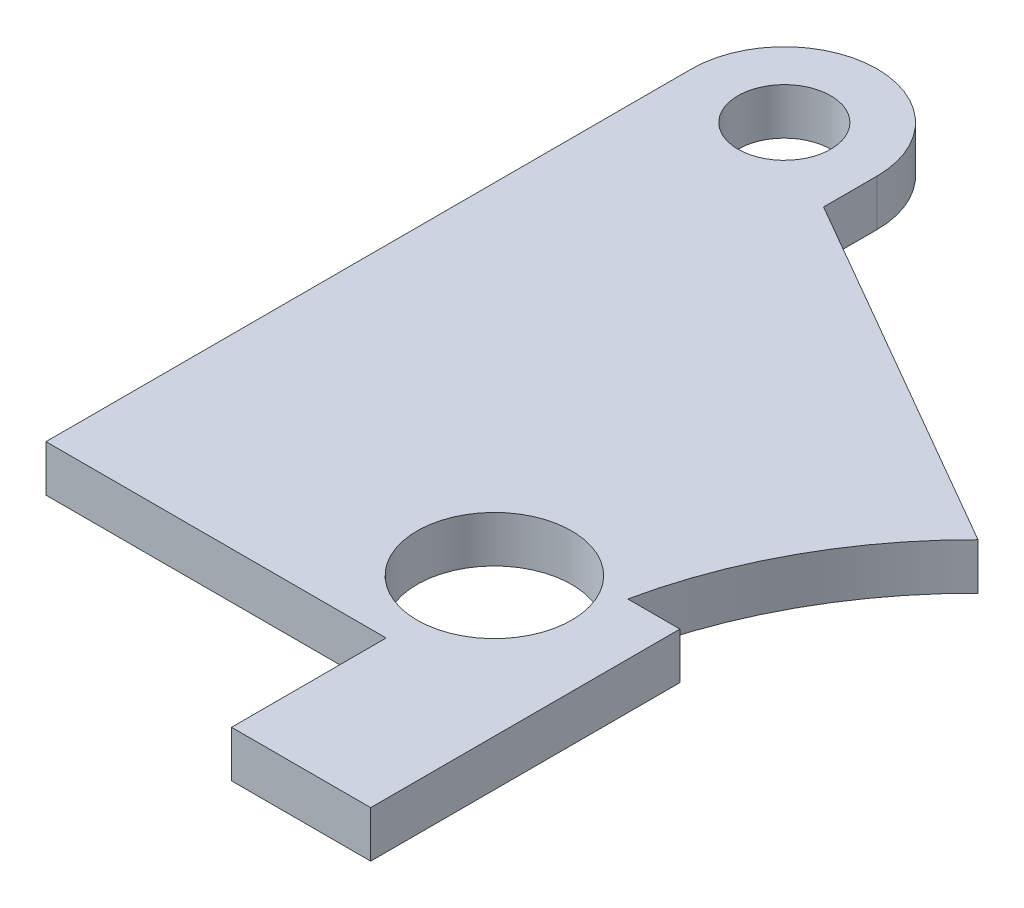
ISO-10303-21;
HEADER;
FILE_DESCRIPTION(('STEP AP214'),'2;1');
FILE_NAME('part.step','',(''),(''),'','','');
FILE_SCHEMA(('AUTOMOTIVE_DESIGN { 1 0 10303 214 1 1 1 1 }'));
ENDSEC;
DATA;
#1=APPLICATION_CONTEXT('core data for automotive mechanical design processes');
#2=APPLICATION_PROTOCOL_DEFINITION('international standard','automotive_design',2000,#1);
#3=PRODUCT_CONTEXT('',#1,'mechanical');
#4=PRODUCT('Part','Part','',(#3));
#5=PRODUCT_RELATED_PRODUCT_CATEGORY('part','',(#4));
#6=PRODUCT_DEFINITION_FORMATION('','',#4);
#7=PRODUCT_DEFINITION_CONTEXT('part definition',#1,'design');
#8=PRODUCT_DEFINITION('design','',#6,#7);
#9=PRODUCT_DEFINITION_SHAPE('','',#8);
#10=(LENGTH_UNIT() NAMED_UNIT(*) SI_UNIT(.MILLI.,.METRE.));
#11=(NAMED_UNIT(*) PLANE_ANGLE_UNIT() SI_UNIT($,.RADIAN.));
#12=(NAMED_UNIT(*) SI_UNIT($,.STERADIAN.) SOLID_ANGLE_UNIT());
#13=UNCERTAINTY_MEASURE_WITH_UNIT(LENGTH_MEASURE(1.E-05),#10,'distance_accuracy_value','');
#14=(GEOMETRIC_REPRESENTATION_CONTEXT(3) GLOBAL_UNCERTAINTY_ASSIGNED_CONTEXT((#13)) GLOBAL_UNIT_ASSIGNED_CONTEXT((#10,
#11,#12)) REPRESENTATION_CONTEXT('',''));
#15=CARTESIAN_POINT('',(0.,0.,0.));
#16=DIRECTION('',(0.,0.,1.));
#17=DIRECTION('',(1.,0.,0.));
#18=AXIS2_PLACEMENT_3D('',#15,#16,#17);
#19=CARTESIAN_POINT('',(11.9115308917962,3.,-51.6599608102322));
#20=DIRECTION('',(0.,1.,0.));
#21=DIRECTION('',(0.,0.,1.));
#22=AXIS2_PLACEMENT_3D('',#19,#20,#21);
#23=PLANE('',#22);
#24=CARTESIAN_POINT('',(11.9115308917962,3.,-51.6599608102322));
#25=DIRECTION('',(0.,1.,0.));
#26=DIRECTION('',(0.,0.,1.));
#27=AXIS2_PLACEMENT_3D('',#24,#25,#26);
#28=CIRCLE('',#27,3.);
#29=CARTESIAN_POINT('',(11.9115308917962,3.,-48.6599608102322));
#30=VERTEX_POINT('',#29);
#31=EDGE_CURVE('E143',#30,#30,#28,.T.);
#32=ORIENTED_EDGE('',*,*,#31,.F.);
#33=EDGE_LOOP('',(#32));
#34=FACE_BOUND('',#33,.T.);
#35=CARTESIAN_POINT('',(11.9115308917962,3.,-51.6599608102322));
#36=DIRECTION('',(0.,1.,0.));
#37=DIRECTION('',(0.,0.,1.));
#38=AXIS2_PLACEMENT_3D('',#35,#36,#37);
#39=CIRCLE('',#38,6.);
#40=CARTESIAN_POINT('',(17.9115308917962,3.,-51.6599608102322));
#41=VERTEX_POINT('',#40);
#42=CARTESIAN_POINT('',(5.91168114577,3.,-51.7024228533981));
#43=VERTEX_POINT('',#42);
#44=EDGE_CURVE('E158',#41,#43,#39,.T.);
#45=ORIENTED_EDGE('',*,*,#44,.T.);
#46=DIRECTION('',(0.,0.,1.));
#47=VECTOR('',#46,1.);
#48=CARTESIAN_POINT('',(5.91168114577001,3.,-9.9056960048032));
#49=LINE('',#48,#47);
#50=CARTESIAN_POINT('',(5.91168114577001,3.,-9.9056960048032));
#51=VERTEX_POINT('',#50);
#52=EDGE_CURVE('E96',#43,#51,#49,.T.);
#53=ORIENTED_EDGE('',*,*,#52,.T.);
#54=DIRECTION('',(1.,0.,0.));
#55=VECTOR('',#54,1.);
#56=CARTESIAN_POINT('',(5.91168114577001,3.,-9.9056960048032));
#57=LINE('',#56,#55);
#58=CARTESIAN_POINT('',(27.9115308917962,3.,-9.90569600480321));
#59=VERTEX_POINT('',#58);
#60=EDGE_CURVE('E179',#51,#59,#57,.T.);
#61=ORIENTED_EDGE('',*,*,#60,.T.);
#62=DIRECTION('',(0.,0.,1.));
#63=VECTOR('',#62,1.);
#64=CARTESIAN_POINT('',(27.9115308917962,3.,0.0943039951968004));
#65=LINE('',#64,#63);
#66=CARTESIAN_POINT('',(27.9115308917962,3.,0.0943039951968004));
#67=VERTEX_POINT('',#66);
#68=EDGE_CURVE('E198',#59,#67,#65,.T.);
#69=ORIENTED_EDGE('',*,*,#68,.T.);
#70=DIRECTION('',(1.,0.,0.));
#71=VECTOR('',#70,1.);
#72=CARTESIAN_POINT('',(27.9115308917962,3.,0.0943039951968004));
#73=LINE('',#72,#71);
#74=CARTESIAN_POINT('',(36.9115308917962,3.,0.0943039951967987));
#75=VERTEX_POINT('',#74);
#76=EDGE_CURVE('E195',#67,#75,#73,.T.);
#77=ORIENTED_EDGE('',*,*,#76,.T.);
#78=DIRECTION('',(0.,0.,-1.));
#79=VECTOR('',#78,1.);
#80=CARTESIAN_POINT('',(36.9115308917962,3.,0.0943039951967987));
#81=LINE('',#80,#79);
#82=CARTESIAN_POINT('',(36.9115308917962,3.,-19.9056960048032));
#83=VERTEX_POINT('',#82);
#84=EDGE_CURVE('E197',#75,#83,#81,.T.);
#85=ORIENTED_EDGE('',*,*,#84,.T.);
#86=DIRECTION('',(-1.,0.,0.));
#87=VECTOR('',#86,1.);
#88=CARTESIAN_POINT('',(33.5390089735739,3.,-19.9056960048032));
#89=LINE('',#88,#87);
#90=CARTESIAN_POINT('',(33.5390089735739,3.,-19.9056960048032));
#91=VERTEX_POINT('',#90);
#92=EDGE_CURVE('E121',#83,#91,#89,.T.);
#93=ORIENTED_EDGE('',*,*,#92,.T.);
#94=CARTESIAN_POINT('',(61.9115308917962,3.,-13.9056960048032));
#95=DIRECTION('',(0.,-1.,0.));
#96=DIRECTION('',(0.,0.,1.));
#97=AXIS2_PLACEMENT_3D('',#94,#95,#96);
#98=CIRCLE('',#97,29.);
#99=CARTESIAN_POINT('',(41.5454185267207,3.,-34.5508278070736));
#100=VERTEX_POINT('',#99);
#101=EDGE_CURVE('E115',#91,#100,#98,.T.);
#102=ORIENTED_EDGE('',*,*,#101,.T.);
#103=DIRECTION('',(-0.866025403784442,0.,-0.499999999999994));
#104=VECTOR('',#103,1.);
#105=CARTESIAN_POINT('',(41.5454185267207,3.,-34.5508278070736));
#106=LINE('',#105,#104);
#107=CARTESIAN_POINT('',(17.9115308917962,3.,-48.1958591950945));
#108=VERTEX_POINT('',#107);
#109=EDGE_CURVE('E119',#100,#108,#106,.T.);
#110=ORIENTED_EDGE('',*,*,#109,.T.);
#111=DIRECTION('',(0.,0.,-1.));
#112=VECTOR('',#111,1.);
#113=CARTESIAN_POINT('',(17.9115308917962,3.,-51.6599608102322));
#114=LINE('',#113,#112);
#115=EDGE_CURVE('E47',#108,#41,#114,.T.);
#116=ORIENTED_EDGE('',*,*,#115,.T.);
#117=EDGE_LOOP('',(#45,#53,#61,#69,#77,#85,#93,#102,#110,#116));
#118=FACE_BOUND('',#117,.T.);
#119=CARTESIAN_POINT('',(27.9115308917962,3.,-16.9056960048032));
#120=DIRECTION('',(0.,1.,0.));
#121=DIRECTION('',(0.,0.,1.));
#122=AXIS2_PLACEMENT_3D('',#119,#120,#121);
#123=CIRCLE('',#122,5.);
#124=CARTESIAN_POINT('',(27.9115308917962,3.,-11.9056960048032));
#125=VERTEX_POINT('',#124);
#126=EDGE_CURVE('E209',#125,#125,#123,.T.);
#127=ORIENTED_EDGE('',*,*,#126,.F.);
#128=EDGE_LOOP('',(#127));
#129=FACE_BOUND('',#128,.T.);
#130=ADVANCED_FACE('F30',(#34,#118,#129),#23,.T.);
#131=CARTESIAN_POINT('',(11.9115308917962,0.,-51.6599608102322));
#132=DIRECTION('',(0.,1.,0.));
#133=DIRECTION('',(0.,0.,1.));
#134=AXIS2_PLACEMENT_3D('',#131,#132,#133);
#135=PLANE('',#134);
#136=CARTESIAN_POINT('',(11.9115308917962,0.,-51.6599608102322));
#137=DIRECTION('',(0.,1.,0.));
#138=DIRECTION('',(0.,0.,1.));
#139=AXIS2_PLACEMENT_3D('',#136,#137,#138);
#140=CIRCLE('',#139,3.);
#141=CARTESIAN_POINT('',(11.9115308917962,0.,-48.6599608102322));
#142=VERTEX_POINT('',#141);
#143=EDGE_CURVE('E206',#142,#142,#140,.T.);
#144=ORIENTED_EDGE('',*,*,#143,.T.);
#145=EDGE_LOOP('',(#144));
#146=FACE_BOUND('',#145,.T.);
#147=CARTESIAN_POINT('',(11.9115308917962,0.,-51.6599608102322));
#148=DIRECTION('',(0.,1.,0.));
#149=DIRECTION('',(0.,0.,1.));
#150=AXIS2_PLACEMENT_3D('',#147,#148,#149);
#151=CIRCLE('',#150,6.);
#152=CARTESIAN_POINT('',(17.9115308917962,0.,-51.6599608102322));
#153=VERTEX_POINT('',#152);
#154=CARTESIAN_POINT('',(5.91168114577,0.,-51.7024228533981));
#155=VERTEX_POINT('',#154);
#156=EDGE_CURVE('E139',#153,#155,#151,.T.);
#157=ORIENTED_EDGE('',*,*,#156,.F.);
#158=DIRECTION('',(0.,0.,-1.));
#159=VECTOR('',#158,1.);
#160=CARTESIAN_POINT('',(17.9115308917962,0.,-51.6599608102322));
#161=LINE('',#160,#159);
#162=CARTESIAN_POINT('',(17.9115308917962,0.,-48.1958591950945));
#163=VERTEX_POINT('',#162);
#164=EDGE_CURVE('E88',#163,#153,#161,.T.);
#165=ORIENTED_EDGE('',*,*,#164,.F.);
#166=DIRECTION('',(-0.866025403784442,0.,-0.499999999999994));
#167=VECTOR('',#166,1.);
#168=CARTESIAN_POINT('',(41.5454185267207,0.,-34.5508278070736));
#169=LINE('',#168,#167);
#170=CARTESIAN_POINT('',(41.5454185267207,0.,-34.5508278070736));
#171=VERTEX_POINT('',#170);
#172=EDGE_CURVE('E82',#171,#163,#169,.T.);
#173=ORIENTED_EDGE('',*,*,#172,.F.);
#174=CARTESIAN_POINT('',(61.9115308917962,0.,-13.9056960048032));
#175=DIRECTION('',(0.,-1.,0.));
#176=DIRECTION('',(0.,0.,1.));
#177=AXIS2_PLACEMENT_3D('',#174,#175,#176);
#178=CIRCLE('',#177,29.);
#179=CARTESIAN_POINT('',(33.5390089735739,0.,-19.9056960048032));
#180=VERTEX_POINT('',#179);
#181=EDGE_CURVE('E129',#180,#171,#178,.T.);
#182=ORIENTED_EDGE('',*,*,#181,.F.);
#183=DIRECTION('',(-1.,0.,0.));
#184=VECTOR('',#183,1.);
#185=CARTESIAN_POINT('',(33.5390089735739,0.,-19.9056960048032));
#186=LINE('',#185,#184);
#187=CARTESIAN_POINT('',(36.9115308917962,0.,-19.9056960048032));
#188=VERTEX_POINT('',#187);
#189=EDGE_CURVE('E153',#188,#180,#186,.T.);
#190=ORIENTED_EDGE('',*,*,#189,.F.);
#191=DIRECTION('',(0.,0.,-1.));
#192=VECTOR('',#191,1.);
#193=CARTESIAN_POINT('',(36.9115308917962,0.,0.0943039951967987));
#194=LINE('',#193,#192);
#195=CARTESIAN_POINT('',(36.9115308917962,0.,0.0943039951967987));
#196=VERTEX_POINT('',#195);
#197=EDGE_CURVE('E151',#196,#188,#194,.T.);
#198=ORIENTED_EDGE('',*,*,#197,.F.);
#199=DIRECTION('',(1.,0.,0.));
#200=VECTOR('',#199,1.);
#201=CARTESIAN_POINT('',(27.9115308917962,0.,0.0943039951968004));
#202=LINE('',#201,#200);
#203=CARTESIAN_POINT('',(27.9115308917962,0.,0.0943039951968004));
#204=VERTEX_POINT('',#203);
#205=EDGE_CURVE('E149',#204,#196,#202,.T.);
#206=ORIENTED_EDGE('',*,*,#205,.F.);
#207=DIRECTION('',(0.,0.,1.));
#208=VECTOR('',#207,1.);
#209=CARTESIAN_POINT('',(27.9115308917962,0.,0.0943039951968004));
#210=LINE('',#209,#208);
#211=CARTESIAN_POINT('',(27.9115308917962,0.,-9.90569600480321));
#212=VERTEX_POINT('',#211);
#213=EDGE_CURVE('E147',#212,#204,#210,.T.);
#214=ORIENTED_EDGE('',*,*,#213,.F.);
#215=DIRECTION('',(1.,0.,0.));
#216=VECTOR('',#215,1.);
#217=CARTESIAN_POINT('',(5.91168114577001,0.,-9.9056960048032));
#218=LINE('',#217,#216);
#219=CARTESIAN_POINT('',(5.91168114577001,0.,-9.9056960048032));
#220=VERTEX_POINT('',#219);
#221=EDGE_CURVE('E145',#220,#212,#218,.T.);
#222=ORIENTED_EDGE('',*,*,#221,.F.);
#223=DIRECTION('',(0.,0.,1.));
#224=VECTOR('',#223,1.);
#225=CARTESIAN_POINT('',(5.91168114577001,0.,-9.9056960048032));
#226=LINE('',#225,#224);
#227=EDGE_CURVE('E142',#155,#220,#226,.T.);
#228=ORIENTED_EDGE('',*,*,#227,.F.);
#229=EDGE_LOOP('',(#157,#165,#173,#182,#190,#198,#206,#214,#222,#228));
#230=FACE_BOUND('',#229,.T.);
#231=CARTESIAN_POINT('',(27.9115308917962,0.,-16.9056960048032));
#232=DIRECTION('',(0.,1.,0.));
#233=DIRECTION('',(0.,0.,1.));
#234=AXIS2_PLACEMENT_3D('',#231,#232,#233);
#235=CIRCLE('',#234,5.);
#236=CARTESIAN_POINT('',(27.9115308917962,0.,-11.9056960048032));
#237=VERTEX_POINT('',#236);
#238=EDGE_CURVE('E212',#237,#237,#235,.T.);
#239=ORIENTED_EDGE('',*,*,#238,.T.);
#240=EDGE_LOOP('',(#239));
#241=FACE_BOUND('',#240,.T.);
#242=ADVANCED_FACE('F183',(#146,#230,#241),#135,.F.);
#243=CARTESIAN_POINT('',(11.9115308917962,3.,-51.6599608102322));
#244=DIRECTION('',(0.,-1.,0.));
#245=DIRECTION('',(0.,0.,-1.));
#246=AXIS2_PLACEMENT_3D('',#243,#244,#245);
#247=CYLINDRICAL_SURFACE('',#246,6.);
#248=ORIENTED_EDGE('',*,*,#156,.T.);
#249=DIRECTION('',(0.,-1.,0.));
#250=VECTOR('',#249,1.);
#251=CARTESIAN_POINT('',(5.91168114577,3.,-51.7024228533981));
#252=LINE('',#251,#250);
#253=EDGE_CURVE('E11',#43,#155,#252,.T.);
#254=ORIENTED_EDGE('',*,*,#253,.F.);
#255=ORIENTED_EDGE('',*,*,#44,.F.);
#256=DIRECTION('',(0.,-1.,0.));
#257=VECTOR('',#256,1.);
#258=CARTESIAN_POINT('',(17.9115308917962,3.,-51.6599608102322));
#259=LINE('',#258,#257);
#260=EDGE_CURVE('E135',#41,#153,#259,.T.);
#261=ORIENTED_EDGE('',*,*,#260,.T.);
#262=EDGE_LOOP('',(#248,#254,#255,#261));
#263=FACE_BOUND('',#262,.T.);
#264=ADVANCED_FACE('F32',(#263),#247,.T.);
#265=CARTESIAN_POINT('',(5.91168114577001,3.,-9.9056960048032));
#266=DIRECTION('',(1.,0.,0.));
#267=DIRECTION('',(0.,0.,-1.));
#268=AXIS2_PLACEMENT_3D('',#265,#266,#267);
#269=PLANE('',#268);
#270=ORIENTED_EDGE('',*,*,#227,.T.);
#271=DIRECTION('',(0.,-1.,0.));
#272=VECTOR('',#271,1.);
#273=CARTESIAN_POINT('',(5.91168114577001,3.,-9.9056960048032));
#274=LINE('',#273,#272);
#275=EDGE_CURVE('E39',#51,#220,#274,.T.);
#276=ORIENTED_EDGE('',*,*,#275,.F.);
#277=ORIENTED_EDGE('',*,*,#52,.F.);
#278=ORIENTED_EDGE('',*,*,#253,.T.);
#279=EDGE_LOOP('',(#270,#276,#277,#278));
#280=FACE_BOUND('',#279,.T.);
#281=ADVANCED_FACE('F253',(#280),#269,.F.);
#282=CARTESIAN_POINT('',(5.91168114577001,3.,-9.9056960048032));
#283=DIRECTION('',(0.,0.,-1.));
#284=DIRECTION('',(-1.,0.,0.));
#285=AXIS2_PLACEMENT_3D('',#282,#283,#284);
#286=PLANE('',#285);
#287=ORIENTED_EDGE('',*,*,#221,.T.);
#288=DIRECTION('',(0.,-1.,0.));
#289=VECTOR('',#288,1.);
#290=CARTESIAN_POINT('',(27.9115308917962,3.,-9.90569600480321));
#291=LINE('',#290,#289);
#292=EDGE_CURVE('E171',#59,#212,#291,.T.);
#293=ORIENTED_EDGE('',*,*,#292,.F.);
#294=ORIENTED_EDGE('',*,*,#60,.F.);
#295=ORIENTED_EDGE('',*,*,#275,.T.);
#296=EDGE_LOOP('',(#287,#293,#294,#295));
#297=FACE_BOUND('',#296,.T.);
#298=ADVANCED_FACE('F177',(#297),#286,.F.);
#299=CARTESIAN_POINT('',(27.9115308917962,3.,0.0943039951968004));
#300=DIRECTION('',(1.,0.,0.));
#301=DIRECTION('',(0.,0.,-1.));
#302=AXIS2_PLACEMENT_3D('',#299,#300,#301);
#303=PLANE('',#302);
#304=ORIENTED_EDGE('',*,*,#213,.T.);
#305=DIRECTION('',(0.,-1.,0.));
#306=VECTOR('',#305,1.);
#307=CARTESIAN_POINT('',(27.9115308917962,3.,0.0943039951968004));
#308=LINE('',#307,#306);
#309=EDGE_CURVE('E168',#67,#204,#308,.T.);
#310=ORIENTED_EDGE('',*,*,#309,.F.);
#311=ORIENTED_EDGE('',*,*,#68,.F.);
#312=ORIENTED_EDGE('',*,*,#292,.T.);
#313=EDGE_LOOP('',(#304,#310,#311,#312));
#314=FACE_BOUND('',#313,.T.);
#315=ADVANCED_FACE('F189',(#314),#303,.F.);
#316=CARTESIAN_POINT('',(27.9115308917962,3.,0.0943039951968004));
#317=DIRECTION('',(0.,0.,-1.));
#318=DIRECTION('',(-1.,0.,0.));
#319=AXIS2_PLACEMENT_3D('',#316,#317,#318);
#320=PLANE('',#319);
#321=ORIENTED_EDGE('',*,*,#205,.T.);
#322=DIRECTION('',(0.,-1.,0.));
#323=VECTOR('',#322,1.);
#324=CARTESIAN_POINT('',(36.9115308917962,3.,0.0943039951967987));
#325=LINE('',#324,#323);
#326=EDGE_CURVE('E165',#75,#196,#325,.T.);
#327=ORIENTED_EDGE('',*,*,#326,.F.);
#328=ORIENTED_EDGE('',*,*,#76,.F.);
#329=ORIENTED_EDGE('',*,*,#309,.T.);
#330=EDGE_LOOP('',(#321,#327,#328,#329));
#331=FACE_BOUND('',#330,.T.);
#332=ADVANCED_FACE('F193',(#331),#320,.F.);
#333=CARTESIAN_POINT('',(36.9115308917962,3.,0.0943039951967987));
#334=DIRECTION('',(-1.,0.,0.));
#335=DIRECTION('',(0.,0.,1.));
#336=AXIS2_PLACEMENT_3D('',#333,#334,#335);
#337=PLANE('',#336);
#338=ORIENTED_EDGE('',*,*,#197,.T.);
#339=DIRECTION('',(0.,-1.,0.));
#340=VECTOR('',#339,1.);
#341=CARTESIAN_POINT('',(36.9115308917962,3.,-19.9056960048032));
#342=LINE('',#341,#340);
#343=EDGE_CURVE('E162',#83,#188,#342,.T.);
#344=ORIENTED_EDGE('',*,*,#343,.F.);
#345=ORIENTED_EDGE('',*,*,#84,.F.);
#346=ORIENTED_EDGE('',*,*,#326,.T.);
#347=EDGE_LOOP('',(#338,#344,#345,#346));
#348=FACE_BOUND('',#347,.T.);
#349=ADVANCED_FACE('F243',(#348),#337,.F.);
#350=CARTESIAN_POINT('',(33.5390089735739,3.,-19.9056960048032));
#351=DIRECTION('',(0.,0.,1.));
#352=DIRECTION('',(1.,0.,0.));
#353=AXIS2_PLACEMENT_3D('',#350,#351,#352);
#354=PLANE('',#353);
#355=ORIENTED_EDGE('',*,*,#189,.T.);
#356=DIRECTION('',(0.,-1.,0.));
#357=VECTOR('',#356,1.);
#358=CARTESIAN_POINT('',(33.5390089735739,3.,-19.9056960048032));
#359=LINE('',#358,#357);
#360=EDGE_CURVE('E130',#91,#180,#359,.T.);
#361=ORIENTED_EDGE('',*,*,#360,.F.);
#362=ORIENTED_EDGE('',*,*,#92,.F.);
#363=ORIENTED_EDGE('',*,*,#343,.T.);
#364=EDGE_LOOP('',(#355,#361,#362,#363));
#365=FACE_BOUND('',#364,.T.);
#366=ADVANCED_FACE('F240',(#365),#354,.F.);
#367=CARTESIAN_POINT('',(61.9115308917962,3.,-13.9056960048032));
#368=DIRECTION('',(0.,-1.,0.));
#369=DIRECTION('',(0.,0.,-1.));
#370=AXIS2_PLACEMENT_3D('',#367,#368,#369);
#371=CYLINDRICAL_SURFACE('',#370,29.);
#372=ORIENTED_EDGE('',*,*,#181,.T.);
#373=DIRECTION('',(0.,-1.,0.));
#374=VECTOR('',#373,1.);
#375=CARTESIAN_POINT('',(41.5454185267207,3.,-34.5508278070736));
#376=LINE('',#375,#374);
#377=EDGE_CURVE('E126',#100,#171,#376,.T.);
#378=ORIENTED_EDGE('',*,*,#377,.F.);
#379=ORIENTED_EDGE('',*,*,#101,.F.);
#380=ORIENTED_EDGE('',*,*,#360,.T.);
#381=EDGE_LOOP('',(#372,#378,#379,#380));
#382=FACE_BOUND('',#381,.T.);
#383=ADVANCED_FACE('F127',(#382),#371,.F.);
#384=CARTESIAN_POINT('',(41.5454185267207,3.,-34.5508278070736));
#385=DIRECTION('',(-0.499999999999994,0.,0.866025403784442));
#386=DIRECTION('',(0.866025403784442,0.,0.499999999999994));
#387=AXIS2_PLACEMENT_3D('',#384,#385,#386);
#388=PLANE('',#387);
#389=ORIENTED_EDGE('',*,*,#172,.T.);
#390=DIRECTION('',(0.,-1.,0.));
#391=VECTOR('',#390,1.);
#392=CARTESIAN_POINT('',(17.9115308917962,3.,-48.1958591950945));
#393=LINE('',#392,#391);
#394=EDGE_CURVE('E131',#108,#163,#393,.T.);
#395=ORIENTED_EDGE('',*,*,#394,.F.);
#396=ORIENTED_EDGE('',*,*,#109,.F.);
#397=ORIENTED_EDGE('',*,*,#377,.T.);
#398=EDGE_LOOP('',(#389,#395,#396,#397));
#399=FACE_BOUND('',#398,.T.);
#400=ADVANCED_FACE('F133',(#399),#388,.F.);
#401=CARTESIAN_POINT('',(17.9115308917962,3.,-51.6599608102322));
#402=DIRECTION('',(-1.,0.,0.));
#403=DIRECTION('',(0.,0.,1.));
#404=AXIS2_PLACEMENT_3D('',#401,#402,#403);
#405=PLANE('',#404);
#406=ORIENTED_EDGE('',*,*,#164,.T.);
#407=ORIENTED_EDGE('',*,*,#260,.F.);
#408=ORIENTED_EDGE('',*,*,#115,.F.);
#409=ORIENTED_EDGE('',*,*,#394,.T.);
#410=EDGE_LOOP('',(#406,#407,#408,#409));
#411=FACE_BOUND('',#410,.T.);
#412=ADVANCED_FACE('F233',(#411),#405,.F.);
#413=CARTESIAN_POINT('',(11.9115308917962,3.,-51.6599608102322));
#414=DIRECTION('',(0.,-1.,0.));
#415=DIRECTION('',(0.,0.,-1.));
#416=AXIS2_PLACEMENT_3D('',#413,#414,#415);
#417=CYLINDRICAL_SURFACE('',#416,3.);
#418=ORIENTED_EDGE('',*,*,#31,.T.);
#419=EDGE_LOOP('',(#418));
#420=FACE_BOUND('',#419,.T.);
#421=ORIENTED_EDGE('',*,*,#143,.F.);
#422=EDGE_LOOP('',(#421));
#423=FACE_BOUND('',#422,.T.);
#424=ADVANCED_FACE('F230',(#420,#423),#417,.F.);
#425=CARTESIAN_POINT('',(27.9115308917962,3.,-16.9056960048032));
#426=DIRECTION('',(0.,-1.,0.));
#427=DIRECTION('',(0.,0.,-1.));
#428=AXIS2_PLACEMENT_3D('',#425,#426,#427);
#429=CYLINDRICAL_SURFACE('',#428,5.);
#430=ORIENTED_EDGE('',*,*,#126,.T.);
#431=EDGE_LOOP('',(#430));
#432=FACE_BOUND('',#431,.T.);
#433=ORIENTED_EDGE('',*,*,#238,.F.);
#434=EDGE_LOOP('',(#433));
#435=FACE_BOUND('',#434,.T.);
#436=ADVANCED_FACE('F218',(#432,#435),#429,.F.);
#437=CLOSED_SHELL('',(#130,#242,#264,#281,#298,#315,#332,#349,#366,#383,#400,#412,#424,#436));
#438=MANIFOLD_SOLID_BREP('B2',#437);
#439=ADVANCED_BREP_SHAPE_REPRESENTATION('',(#18,#438),#14);
#440=SHAPE_DEFINITION_REPRESENTATION(#9,#439);
ENDSEC;
END-ISO-10303-21;
